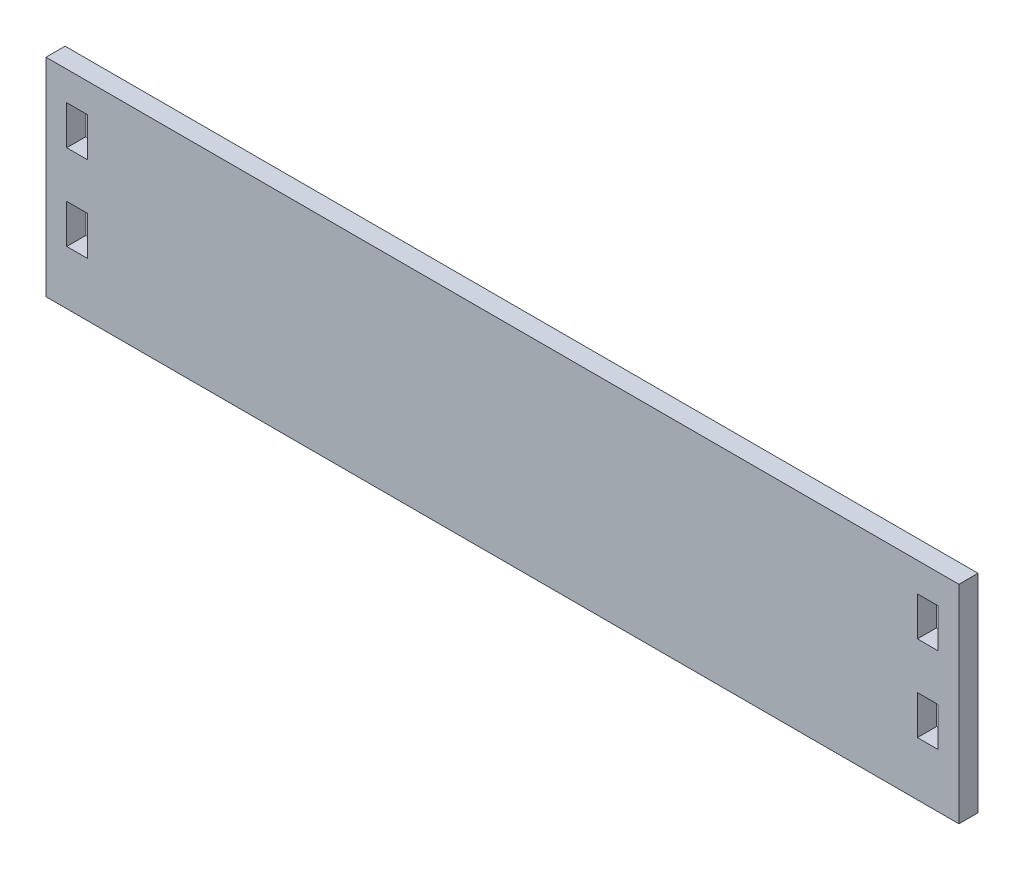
ISO-10303-21;
HEADER;
FILE_DESCRIPTION(('STEP AP214'),'2;1');
FILE_NAME('part.step','',(''),(''),'','','');
FILE_SCHEMA(('AUTOMOTIVE_DESIGN { 1 0 10303 214 1 1 1 1 }'));
ENDSEC;
DATA;
#1=APPLICATION_CONTEXT('core data for automotive mechanical design processes');
#2=APPLICATION_PROTOCOL_DEFINITION('international standard','automotive_design',2000,#1);
#3=PRODUCT_CONTEXT('',#1,'mechanical');
#4=PRODUCT('Part','Part','',(#3));
#5=PRODUCT_RELATED_PRODUCT_CATEGORY('part','',(#4));
#6=PRODUCT_DEFINITION_FORMATION('','',#4);
#7=PRODUCT_DEFINITION_CONTEXT('part definition',#1,'design');
#8=PRODUCT_DEFINITION('design','',#6,#7);
#9=PRODUCT_DEFINITION_SHAPE('','',#8);
#10=(LENGTH_UNIT() NAMED_UNIT(*) SI_UNIT(.MILLI.,.METRE.));
#11=(NAMED_UNIT(*) PLANE_ANGLE_UNIT() SI_UNIT($,.RADIAN.));
#12=(NAMED_UNIT(*) SI_UNIT($,.STERADIAN.) SOLID_ANGLE_UNIT());
#13=UNCERTAINTY_MEASURE_WITH_UNIT(LENGTH_MEASURE(1.E-05),#10,'distance_accuracy_value','');
#14=(GEOMETRIC_REPRESENTATION_CONTEXT(3) GLOBAL_UNCERTAINTY_ASSIGNED_CONTEXT((#13)) GLOBAL_UNIT_ASSIGNED_CONTEXT((#10,
#11,#12)) REPRESENTATION_CONTEXT('',''));
#15=CARTESIAN_POINT('',(0.,0.,0.));
#16=DIRECTION('',(0.,0.,1.));
#17=DIRECTION('',(1.,0.,0.));
#18=AXIS2_PLACEMENT_3D('',#15,#16,#17);
#19=CARTESIAN_POINT('',(0.,0.,5.842));
#20=DIRECTION('',(0.,0.,-1.));
#21=DIRECTION('',(-1.,0.,0.));
#22=AXIS2_PLACEMENT_3D('',#19,#20,#21);
#23=PLANE('',#22);
#24=DIRECTION('',(-1.,0.,0.));
#25=VECTOR('',#24,1.);
#26=CARTESIAN_POINT('',(273.05,54.61,5.842));
#27=LINE('',#26,#25);
#28=CARTESIAN_POINT('',(273.05,54.61,5.842));
#29=VERTEX_POINT('',#28);
#30=CARTESIAN_POINT('',(266.7,54.61,5.842));
#31=VERTEX_POINT('',#30);
#32=EDGE_CURVE('E206',#29,#31,#27,.T.);
#33=ORIENTED_EDGE('',*,*,#32,.F.);
#34=DIRECTION('',(0.,1.,0.));
#35=VECTOR('',#34,1.);
#36=CARTESIAN_POINT('',(273.05,54.61,5.842));
#37=LINE('',#36,#35);
#38=CARTESIAN_POINT('',(273.05,42.672,5.842));
#39=VERTEX_POINT('',#38);
#40=EDGE_CURVE('E214',#39,#29,#37,.T.);
#41=ORIENTED_EDGE('',*,*,#40,.F.);
#42=DIRECTION('',(1.,0.,0.));
#43=VECTOR('',#42,1.);
#44=CARTESIAN_POINT('',(273.05,42.672,5.842));
#45=LINE('',#44,#43);
#46=CARTESIAN_POINT('',(266.7,42.672,5.842));
#47=VERTEX_POINT('',#46);
#48=EDGE_CURVE('E211',#47,#39,#45,.T.);
#49=ORIENTED_EDGE('',*,*,#48,.F.);
#50=DIRECTION('',(0.,-1.,0.));
#51=VECTOR('',#50,1.);
#52=CARTESIAN_POINT('',(266.7,54.61,5.842));
#53=LINE('',#52,#51);
#54=EDGE_CURVE('E208',#31,#47,#53,.T.);
#55=ORIENTED_EDGE('',*,*,#54,.F.);
#56=EDGE_LOOP('',(#33,#41,#49,#55));
#57=FACE_BOUND('',#56,.T.);
#58=DIRECTION('',(0.,-1.,0.));
#59=VECTOR('',#58,1.);
#60=CARTESIAN_POINT('',(6.35,28.448,5.842));
#61=LINE('',#60,#59);
#62=CARTESIAN_POINT('',(6.35,28.448,5.842));
#63=VERTEX_POINT('',#62);
#64=CARTESIAN_POINT('',(6.35,16.51,5.842));
#65=VERTEX_POINT('',#64);
#66=EDGE_CURVE('E268',#63,#65,#61,.T.);
#67=ORIENTED_EDGE('',*,*,#66,.F.);
#68=DIRECTION('',(-1.,0.,0.));
#69=VECTOR('',#68,1.);
#70=CARTESIAN_POINT('',(6.35,28.448,5.842));
#71=LINE('',#70,#69);
#72=CARTESIAN_POINT('',(12.7,28.448,5.842));
#73=VERTEX_POINT('',#72);
#74=EDGE_CURVE('E276',#73,#63,#71,.T.);
#75=ORIENTED_EDGE('',*,*,#74,.F.);
#76=DIRECTION('',(0.,1.,0.));
#77=VECTOR('',#76,1.);
#78=CARTESIAN_POINT('',(12.7,28.448,5.842));
#79=LINE('',#78,#77);
#80=CARTESIAN_POINT('',(12.7,16.51,5.842));
#81=VERTEX_POINT('',#80);
#82=EDGE_CURVE('E273',#81,#73,#79,.T.);
#83=ORIENTED_EDGE('',*,*,#82,.F.);
#84=DIRECTION('',(1.,0.,0.));
#85=VECTOR('',#84,1.);
#86=CARTESIAN_POINT('',(6.35,16.51,5.842));
#87=LINE('',#86,#85);
#88=EDGE_CURVE('E270',#65,#81,#87,.T.);
#89=ORIENTED_EDGE('',*,*,#88,.F.);
#90=EDGE_LOOP('',(#67,#75,#83,#89));
#91=FACE_BOUND('',#90,.T.);
#92=DIRECTION('',(0.,-1.,0.));
#93=VECTOR('',#92,1.);
#94=CARTESIAN_POINT('',(0.,0.,5.842));
#95=LINE('',#94,#93);
#96=CARTESIAN_POINT('',(0.,63.5,5.842));
#97=VERTEX_POINT('',#96);
#98=CARTESIAN_POINT('',(0.,0.,5.842));
#99=VERTEX_POINT('',#98);
#100=EDGE_CURVE('E299',#97,#99,#95,.T.);
#101=ORIENTED_EDGE('',*,*,#100,.T.);
#102=DIRECTION('',(1.,0.,0.));
#103=VECTOR('',#102,1.);
#104=CARTESIAN_POINT('',(0.,0.,5.842));
#105=LINE('',#104,#103);
#106=CARTESIAN_POINT('',(279.4,0.,5.842));
#107=VERTEX_POINT('',#106);
#108=EDGE_CURVE('E302',#99,#107,#105,.T.);
#109=ORIENTED_EDGE('',*,*,#108,.T.);
#110=DIRECTION('',(0.,1.,0.));
#111=VECTOR('',#110,1.);
#112=CARTESIAN_POINT('',(279.4,0.,5.842));
#113=LINE('',#112,#111);
#114=CARTESIAN_POINT('',(279.4,63.5,5.842));
#115=VERTEX_POINT('',#114);
#116=EDGE_CURVE('E305',#107,#115,#113,.T.);
#117=ORIENTED_EDGE('',*,*,#116,.T.);
#118=DIRECTION('',(-1.,0.,0.));
#119=VECTOR('',#118,1.);
#120=CARTESIAN_POINT('',(0.,63.5,5.842));
#121=LINE('',#120,#119);
#122=EDGE_CURVE('E307',#115,#97,#121,.T.);
#123=ORIENTED_EDGE('',*,*,#122,.T.);
#124=EDGE_LOOP('',(#101,#109,#117,#123));
#125=FACE_BOUND('',#124,.T.);
#126=DIRECTION('',(0.,-1.,0.));
#127=VECTOR('',#126,1.);
#128=CARTESIAN_POINT('',(6.35,54.61,5.842));
#129=LINE('',#128,#127);
#130=CARTESIAN_POINT('',(6.35,54.61,5.842));
#131=VERTEX_POINT('',#130);
#132=CARTESIAN_POINT('',(6.35,42.672,5.842));
#133=VERTEX_POINT('',#132);
#134=EDGE_CURVE('E237',#131,#133,#129,.T.);
#135=ORIENTED_EDGE('',*,*,#134,.F.);
#136=DIRECTION('',(-1.,0.,0.));
#137=VECTOR('',#136,1.);
#138=CARTESIAN_POINT('',(6.35,54.61,5.842));
#139=LINE('',#138,#137);
#140=CARTESIAN_POINT('',(12.7,54.61,5.842));
#141=VERTEX_POINT('',#140);
#142=EDGE_CURVE('E245',#141,#131,#139,.T.);
#143=ORIENTED_EDGE('',*,*,#142,.F.);
#144=DIRECTION('',(0.,1.,0.));
#145=VECTOR('',#144,1.);
#146=CARTESIAN_POINT('',(12.7,54.61,5.842));
#147=LINE('',#146,#145);
#148=CARTESIAN_POINT('',(12.7,42.672,5.842));
#149=VERTEX_POINT('',#148);
#150=EDGE_CURVE('E242',#149,#141,#147,.T.);
#151=ORIENTED_EDGE('',*,*,#150,.F.);
#152=DIRECTION('',(1.,0.,0.));
#153=VECTOR('',#152,1.);
#154=CARTESIAN_POINT('',(6.35,42.672,5.842));
#155=LINE('',#154,#153);
#156=EDGE_CURVE('E239',#133,#149,#155,.T.);
#157=ORIENTED_EDGE('',*,*,#156,.F.);
#158=EDGE_LOOP('',(#135,#143,#151,#157));
#159=FACE_BOUND('',#158,.T.);
#160=DIRECTION('',(-1.,0.,0.));
#161=VECTOR('',#160,1.);
#162=CARTESIAN_POINT('',(273.05,28.4480000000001,5.842));
#163=LINE('',#162,#161);
#164=CARTESIAN_POINT('',(273.05,28.4480000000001,5.842));
#165=VERTEX_POINT('',#164);
#166=CARTESIAN_POINT('',(266.7,28.448,5.842));
#167=VERTEX_POINT('',#166);
#168=EDGE_CURVE('E170',#165,#167,#163,.T.);
#169=ORIENTED_EDGE('',*,*,#168,.F.);
#170=DIRECTION('',(0.,1.,0.));
#171=VECTOR('',#170,1.);
#172=CARTESIAN_POINT('',(273.05,28.4480000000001,5.842));
#173=LINE('',#172,#171);
#174=CARTESIAN_POINT('',(273.05,16.51,5.842));
#175=VERTEX_POINT('',#174);
#176=EDGE_CURVE('E192',#175,#165,#173,.T.);
#177=ORIENTED_EDGE('',*,*,#176,.F.);
#178=DIRECTION('',(1.,0.,0.));
#179=VECTOR('',#178,1.);
#180=CARTESIAN_POINT('',(273.05,16.51,5.842));
#181=LINE('',#180,#179);
#182=CARTESIAN_POINT('',(266.7,16.5100000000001,5.842));
#183=VERTEX_POINT('',#182);
#184=EDGE_CURVE('E190',#183,#175,#181,.T.);
#185=ORIENTED_EDGE('',*,*,#184,.F.);
#186=DIRECTION('',(0.,-1.,0.));
#187=VECTOR('',#186,1.);
#188=CARTESIAN_POINT('',(266.7,28.448,5.842));
#189=LINE('',#188,#187);
#190=EDGE_CURVE('E178',#167,#183,#189,.T.);
#191=ORIENTED_EDGE('',*,*,#190,.F.);
#192=EDGE_LOOP('',(#169,#177,#185,#191));
#193=FACE_BOUND('',#192,.T.);
#194=ADVANCED_FACE('F33',(#57,#91,#125,#159,#193),#23,.F.);
#195=CARTESIAN_POINT('',(0.,0.,0.));
#196=DIRECTION('',(0.,0.,-1.));
#197=DIRECTION('',(-1.,0.,0.));
#198=AXIS2_PLACEMENT_3D('',#195,#196,#197);
#199=PLANE('',#198);
#200=DIRECTION('',(0.,-1.,0.));
#201=VECTOR('',#200,1.);
#202=CARTESIAN_POINT('',(0.,0.,0.));
#203=LINE('',#202,#201);
#204=CARTESIAN_POINT('',(0.,63.5,0.));
#205=VERTEX_POINT('',#204);
#206=CARTESIAN_POINT('',(0.,0.,0.));
#207=VERTEX_POINT('',#206);
#208=EDGE_CURVE('E298',#205,#207,#203,.T.);
#209=ORIENTED_EDGE('',*,*,#208,.F.);
#210=DIRECTION('',(-1.,0.,0.));
#211=VECTOR('',#210,1.);
#212=CARTESIAN_POINT('',(0.,63.5,0.));
#213=LINE('',#212,#211);
#214=CARTESIAN_POINT('',(279.4,63.5,0.));
#215=VERTEX_POINT('',#214);
#216=EDGE_CURVE('E303',#215,#205,#213,.T.);
#217=ORIENTED_EDGE('',*,*,#216,.F.);
#218=DIRECTION('',(0.,1.,0.));
#219=VECTOR('',#218,1.);
#220=CARTESIAN_POINT('',(279.4,0.,0.));
#221=LINE('',#220,#219);
#222=CARTESIAN_POINT('',(279.4,0.,0.));
#223=VERTEX_POINT('',#222);
#224=EDGE_CURVE('E314',#223,#215,#221,.T.);
#225=ORIENTED_EDGE('',*,*,#224,.F.);
#226=DIRECTION('',(1.,0.,0.));
#227=VECTOR('',#226,1.);
#228=CARTESIAN_POINT('',(0.,0.,0.));
#229=LINE('',#228,#227);
#230=EDGE_CURVE('E312',#207,#223,#229,.T.);
#231=ORIENTED_EDGE('',*,*,#230,.F.);
#232=EDGE_LOOP('',(#209,#217,#225,#231));
#233=FACE_BOUND('',#232,.T.);
#234=DIRECTION('',(-1.,0.,0.));
#235=VECTOR('',#234,1.);
#236=CARTESIAN_POINT('',(6.35,28.448,0.));
#237=LINE('',#236,#235);
#238=CARTESIAN_POINT('',(12.7,28.448,0.));
#239=VERTEX_POINT('',#238);
#240=CARTESIAN_POINT('',(6.35,28.448,0.));
#241=VERTEX_POINT('',#240);
#242=EDGE_CURVE('E271',#239,#241,#237,.T.);
#243=ORIENTED_EDGE('',*,*,#242,.T.);
#244=DIRECTION('',(0.,-1.,0.));
#245=VECTOR('',#244,1.);
#246=CARTESIAN_POINT('',(6.35,28.448,0.));
#247=LINE('',#246,#245);
#248=CARTESIAN_POINT('',(6.35,16.51,0.));
#249=VERTEX_POINT('',#248);
#250=EDGE_CURVE('E267',#241,#249,#247,.T.);
#251=ORIENTED_EDGE('',*,*,#250,.T.);
#252=DIRECTION('',(1.,0.,0.));
#253=VECTOR('',#252,1.);
#254=CARTESIAN_POINT('',(6.35,16.51,0.));
#255=LINE('',#254,#253);
#256=CARTESIAN_POINT('',(12.7,16.51,0.));
#257=VERTEX_POINT('',#256);
#258=EDGE_CURVE('E281',#249,#257,#255,.T.);
#259=ORIENTED_EDGE('',*,*,#258,.T.);
#260=DIRECTION('',(0.,1.,0.));
#261=VECTOR('',#260,1.);
#262=CARTESIAN_POINT('',(12.7,28.448,0.));
#263=LINE('',#262,#261);
#264=EDGE_CURVE('E284',#257,#239,#263,.T.);
#265=ORIENTED_EDGE('',*,*,#264,.T.);
#266=EDGE_LOOP('',(#243,#251,#259,#265));
#267=FACE_BOUND('',#266,.T.);
#268=DIRECTION('',(-1.,0.,0.));
#269=VECTOR('',#268,1.);
#270=CARTESIAN_POINT('',(6.35,54.61,0.));
#271=LINE('',#270,#269);
#272=CARTESIAN_POINT('',(12.7,54.61,0.));
#273=VERTEX_POINT('',#272);
#274=CARTESIAN_POINT('',(6.35,54.61,0.));
#275=VERTEX_POINT('',#274);
#276=EDGE_CURVE('E240',#273,#275,#271,.T.);
#277=ORIENTED_EDGE('',*,*,#276,.T.);
#278=DIRECTION('',(0.,-1.,0.));
#279=VECTOR('',#278,1.);
#280=CARTESIAN_POINT('',(6.35,54.61,0.));
#281=LINE('',#280,#279);
#282=CARTESIAN_POINT('',(6.35,42.672,0.));
#283=VERTEX_POINT('',#282);
#284=EDGE_CURVE('E236',#275,#283,#281,.T.);
#285=ORIENTED_EDGE('',*,*,#284,.T.);
#286=DIRECTION('',(1.,0.,0.));
#287=VECTOR('',#286,1.);
#288=CARTESIAN_POINT('',(6.35,42.672,0.));
#289=LINE('',#288,#287);
#290=CARTESIAN_POINT('',(12.7,42.672,0.));
#291=VERTEX_POINT('',#290);
#292=EDGE_CURVE('E250',#283,#291,#289,.T.);
#293=ORIENTED_EDGE('',*,*,#292,.T.);
#294=DIRECTION('',(0.,1.,0.));
#295=VECTOR('',#294,1.);
#296=CARTESIAN_POINT('',(12.7,54.61,0.));
#297=LINE('',#296,#295);
#298=EDGE_CURVE('E253',#291,#273,#297,.T.);
#299=ORIENTED_EDGE('',*,*,#298,.T.);
#300=EDGE_LOOP('',(#277,#285,#293,#299));
#301=FACE_BOUND('',#300,.T.);
#302=DIRECTION('',(0.,1.,0.));
#303=VECTOR('',#302,1.);
#304=CARTESIAN_POINT('',(273.05,54.61,0.));
#305=LINE('',#304,#303);
#306=CARTESIAN_POINT('',(273.05,42.672,0.));
#307=VERTEX_POINT('',#306);
#308=CARTESIAN_POINT('',(273.05,54.61,0.));
#309=VERTEX_POINT('',#308);
#310=EDGE_CURVE('E209',#307,#309,#305,.T.);
#311=ORIENTED_EDGE('',*,*,#310,.T.);
#312=DIRECTION('',(-1.,0.,0.));
#313=VECTOR('',#312,1.);
#314=CARTESIAN_POINT('',(273.05,54.61,0.));
#315=LINE('',#314,#313);
#316=CARTESIAN_POINT('',(266.7,54.61,0.));
#317=VERTEX_POINT('',#316);
#318=EDGE_CURVE('E186',#309,#317,#315,.T.);
#319=ORIENTED_EDGE('',*,*,#318,.T.);
#320=DIRECTION('',(0.,-1.,0.));
#321=VECTOR('',#320,1.);
#322=CARTESIAN_POINT('',(266.7,54.61,0.));
#323=LINE('',#322,#321);
#324=CARTESIAN_POINT('',(266.7,42.672,0.));
#325=VERTEX_POINT('',#324);
#326=EDGE_CURVE('E219',#317,#325,#323,.T.);
#327=ORIENTED_EDGE('',*,*,#326,.T.);
#328=DIRECTION('',(1.,0.,0.));
#329=VECTOR('',#328,1.);
#330=CARTESIAN_POINT('',(273.05,42.672,0.));
#331=LINE('',#330,#329);
#332=EDGE_CURVE('E222',#325,#307,#331,.T.);
#333=ORIENTED_EDGE('',*,*,#332,.T.);
#334=EDGE_LOOP('',(#311,#319,#327,#333));
#335=FACE_BOUND('',#334,.T.);
#336=DIRECTION('',(0.,1.,0.));
#337=VECTOR('',#336,1.);
#338=CARTESIAN_POINT('',(273.05,28.4480000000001,0.));
#339=LINE('',#338,#337);
#340=CARTESIAN_POINT('',(273.05,16.51,0.));
#341=VERTEX_POINT('',#340);
#342=CARTESIAN_POINT('',(273.05,28.4480000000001,0.));
#343=VERTEX_POINT('',#342);
#344=EDGE_CURVE('E179',#341,#343,#339,.T.);
#345=ORIENTED_EDGE('',*,*,#344,.T.);
#346=DIRECTION('',(-1.,0.,0.));
#347=VECTOR('',#346,1.);
#348=CARTESIAN_POINT('',(273.05,28.4480000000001,0.));
#349=LINE('',#348,#347);
#350=CARTESIAN_POINT('',(266.7,28.448,0.));
#351=VERTEX_POINT('',#350);
#352=EDGE_CURVE('E56',#343,#351,#349,.T.);
#353=ORIENTED_EDGE('',*,*,#352,.T.);
#354=DIRECTION('',(0.,-1.,0.));
#355=VECTOR('',#354,1.);
#356=CARTESIAN_POINT('',(266.7,28.448,0.));
#357=LINE('',#356,#355);
#358=CARTESIAN_POINT('',(266.7,16.5100000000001,0.));
#359=VERTEX_POINT('',#358);
#360=EDGE_CURVE('E185',#351,#359,#357,.T.);
#361=ORIENTED_EDGE('',*,*,#360,.T.);
#362=DIRECTION('',(1.,0.,0.));
#363=VECTOR('',#362,1.);
#364=CARTESIAN_POINT('',(273.05,16.51,0.));
#365=LINE('',#364,#363);
#366=EDGE_CURVE('E198',#359,#341,#365,.T.);
#367=ORIENTED_EDGE('',*,*,#366,.T.);
#368=EDGE_LOOP('',(#345,#353,#361,#367));
#369=FACE_BOUND('',#368,.T.);
#370=ADVANCED_FACE('F332',(#233,#267,#301,#335,#369),#199,.T.);
#371=CARTESIAN_POINT('',(0.,0.,5.842));
#372=DIRECTION('',(1.,0.,0.));
#373=DIRECTION('',(0.,0.,-1.));
#374=AXIS2_PLACEMENT_3D('',#371,#372,#373);
#375=PLANE('',#374);
#376=ORIENTED_EDGE('',*,*,#208,.T.);
#377=DIRECTION('',(0.,0.,-1.));
#378=VECTOR('',#377,1.);
#379=CARTESIAN_POINT('',(0.,0.,5.842));
#380=LINE('',#379,#378);
#381=EDGE_CURVE('E11',#99,#207,#380,.T.);
#382=ORIENTED_EDGE('',*,*,#381,.F.);
#383=ORIENTED_EDGE('',*,*,#100,.F.);
#384=DIRECTION('',(0.,0.,-1.));
#385=VECTOR('',#384,1.);
#386=CARTESIAN_POINT('',(0.,63.5,5.842));
#387=LINE('',#386,#385);
#388=EDGE_CURVE('E309',#97,#205,#387,.T.);
#389=ORIENTED_EDGE('',*,*,#388,.T.);
#390=EDGE_LOOP('',(#376,#382,#383,#389));
#391=FACE_BOUND('',#390,.T.);
#392=ADVANCED_FACE('F35',(#391),#375,.F.);
#393=CARTESIAN_POINT('',(0.,0.,5.842));
#394=DIRECTION('',(0.,1.,0.));
#395=DIRECTION('',(0.,0.,1.));
#396=AXIS2_PLACEMENT_3D('',#393,#394,#395);
#397=PLANE('',#396);
#398=ORIENTED_EDGE('',*,*,#230,.T.);
#399=DIRECTION('',(0.,0.,-1.));
#400=VECTOR('',#399,1.);
#401=CARTESIAN_POINT('',(279.4,0.,5.842));
#402=LINE('',#401,#400);
#403=EDGE_CURVE('E41',#107,#223,#402,.T.);
#404=ORIENTED_EDGE('',*,*,#403,.F.);
#405=ORIENTED_EDGE('',*,*,#108,.F.);
#406=ORIENTED_EDGE('',*,*,#381,.T.);
#407=EDGE_LOOP('',(#398,#404,#405,#406));
#408=FACE_BOUND('',#407,.T.);
#409=ADVANCED_FACE('F343',(#408),#397,.F.);
#410=CARTESIAN_POINT('',(279.4,0.,5.842));
#411=DIRECTION('',(-1.,0.,0.));
#412=DIRECTION('',(0.,0.,1.));
#413=AXIS2_PLACEMENT_3D('',#410,#411,#412);
#414=PLANE('',#413);
#415=ORIENTED_EDGE('',*,*,#224,.T.);
#416=DIRECTION('',(0.,0.,-1.));
#417=VECTOR('',#416,1.);
#418=CARTESIAN_POINT('',(279.4,63.5,5.842));
#419=LINE('',#418,#417);
#420=EDGE_CURVE('E319',#115,#215,#419,.T.);
#421=ORIENTED_EDGE('',*,*,#420,.F.);
#422=ORIENTED_EDGE('',*,*,#116,.F.);
#423=ORIENTED_EDGE('',*,*,#403,.T.);
#424=EDGE_LOOP('',(#415,#421,#422,#423));
#425=FACE_BOUND('',#424,.T.);
#426=ADVANCED_FACE('F326',(#425),#414,.F.);
#427=CARTESIAN_POINT('',(0.,63.5,5.842));
#428=DIRECTION('',(0.,-1.,0.));
#429=DIRECTION('',(0.,0.,-1.));
#430=AXIS2_PLACEMENT_3D('',#427,#428,#429);
#431=PLANE('',#430);
#432=ORIENTED_EDGE('',*,*,#216,.T.);
#433=ORIENTED_EDGE('',*,*,#388,.F.);
#434=ORIENTED_EDGE('',*,*,#122,.F.);
#435=ORIENTED_EDGE('',*,*,#420,.T.);
#436=EDGE_LOOP('',(#432,#433,#434,#435));
#437=FACE_BOUND('',#436,.T.);
#438=ADVANCED_FACE('F336',(#437),#431,.F.);
#439=CARTESIAN_POINT('',(6.35,28.448,5.842));
#440=DIRECTION('',(1.,0.,0.));
#441=DIRECTION('',(0.,1.,0.));
#442=AXIS2_PLACEMENT_3D('',#439,#440,#441);
#443=PLANE('',#442);
#444=ORIENTED_EDGE('',*,*,#250,.F.);
#445=DIRECTION('',(0.,0.,-1.));
#446=VECTOR('',#445,1.);
#447=CARTESIAN_POINT('',(6.35,28.448,5.842));
#448=LINE('',#447,#446);
#449=EDGE_CURVE('E278',#63,#241,#448,.T.);
#450=ORIENTED_EDGE('',*,*,#449,.F.);
#451=ORIENTED_EDGE('',*,*,#66,.T.);
#452=DIRECTION('',(0.,0.,-1.));
#453=VECTOR('',#452,1.);
#454=CARTESIAN_POINT('',(6.35,16.51,5.842));
#455=LINE('',#454,#453);
#456=EDGE_CURVE('E295',#65,#249,#455,.T.);
#457=ORIENTED_EDGE('',*,*,#456,.T.);
#458=EDGE_LOOP('',(#444,#450,#451,#457));
#459=FACE_BOUND('',#458,.T.);
#460=ADVANCED_FACE('F360',(#459),#443,.T.);
#461=CARTESIAN_POINT('',(6.35,16.51,5.842));
#462=DIRECTION('',(0.,1.,0.));
#463=DIRECTION('',(0.,0.,1.));
#464=AXIS2_PLACEMENT_3D('',#461,#462,#463);
#465=PLANE('',#464);
#466=ORIENTED_EDGE('',*,*,#258,.F.);
#467=ORIENTED_EDGE('',*,*,#456,.F.);
#468=ORIENTED_EDGE('',*,*,#88,.T.);
#469=DIRECTION('',(0.,0.,-1.));
#470=VECTOR('',#469,1.);
#471=CARTESIAN_POINT('',(12.7,16.51,5.842));
#472=LINE('',#471,#470);
#473=EDGE_CURVE('E293',#81,#257,#472,.T.);
#474=ORIENTED_EDGE('',*,*,#473,.T.);
#475=EDGE_LOOP('',(#466,#467,#468,#474));
#476=FACE_BOUND('',#475,.T.);
#477=ADVANCED_FACE('F367',(#476),#465,.T.);
#478=CARTESIAN_POINT('',(12.7,28.448,5.842));
#479=DIRECTION('',(-1.,0.,0.));
#480=DIRECTION('',(0.,-1.,0.));
#481=AXIS2_PLACEMENT_3D('',#478,#479,#480);
#482=PLANE('',#481);
#483=ORIENTED_EDGE('',*,*,#264,.F.);
#484=ORIENTED_EDGE('',*,*,#473,.F.);
#485=ORIENTED_EDGE('',*,*,#82,.T.);
#486=DIRECTION('',(0.,0.,-1.));
#487=VECTOR('',#486,1.);
#488=CARTESIAN_POINT('',(12.7,28.448,5.842));
#489=LINE('',#488,#487);
#490=EDGE_CURVE('E291',#73,#239,#489,.T.);
#491=ORIENTED_EDGE('',*,*,#490,.T.);
#492=EDGE_LOOP('',(#483,#484,#485,#491));
#493=FACE_BOUND('',#492,.T.);
#494=ADVANCED_FACE('F372',(#493),#482,.T.);
#495=CARTESIAN_POINT('',(6.35,28.448,5.842));
#496=DIRECTION('',(0.,-1.,0.));
#497=DIRECTION('',(1.,0.,0.));
#498=AXIS2_PLACEMENT_3D('',#495,#496,#497);
#499=PLANE('',#498);
#500=ORIENTED_EDGE('',*,*,#242,.F.);
#501=ORIENTED_EDGE('',*,*,#490,.F.);
#502=ORIENTED_EDGE('',*,*,#74,.T.);
#503=ORIENTED_EDGE('',*,*,#449,.T.);
#504=EDGE_LOOP('',(#500,#501,#502,#503));
#505=FACE_BOUND('',#504,.T.);
#506=ADVANCED_FACE('F379',(#505),#499,.T.);
#507=CARTESIAN_POINT('',(6.35,54.61,5.842));
#508=DIRECTION('',(1.,0.,0.));
#509=DIRECTION('',(0.,1.,0.));
#510=AXIS2_PLACEMENT_3D('',#507,#508,#509);
#511=PLANE('',#510);
#512=ORIENTED_EDGE('',*,*,#284,.F.);
#513=DIRECTION('',(0.,0.,-1.));
#514=VECTOR('',#513,1.);
#515=CARTESIAN_POINT('',(6.35,54.61,5.842));
#516=LINE('',#515,#514);
#517=EDGE_CURVE('E247',#131,#275,#516,.T.);
#518=ORIENTED_EDGE('',*,*,#517,.F.);
#519=ORIENTED_EDGE('',*,*,#134,.T.);
#520=DIRECTION('',(0.,0.,-1.));
#521=VECTOR('',#520,1.);
#522=CARTESIAN_POINT('',(6.35,42.672,5.842));
#523=LINE('',#522,#521);
#524=EDGE_CURVE('E264',#133,#283,#523,.T.);
#525=ORIENTED_EDGE('',*,*,#524,.T.);
#526=EDGE_LOOP('',(#512,#518,#519,#525));
#527=FACE_BOUND('',#526,.T.);
#528=ADVANCED_FACE('F392',(#527),#511,.T.);
#529=CARTESIAN_POINT('',(6.35,42.672,5.842));
#530=DIRECTION('',(0.,1.,0.));
#531=DIRECTION('',(-1.,0.,0.));
#532=AXIS2_PLACEMENT_3D('',#529,#530,#531);
#533=PLANE('',#532);
#534=ORIENTED_EDGE('',*,*,#292,.F.);
#535=ORIENTED_EDGE('',*,*,#524,.F.);
#536=ORIENTED_EDGE('',*,*,#156,.T.);
#537=DIRECTION('',(0.,0.,-1.));
#538=VECTOR('',#537,1.);
#539=CARTESIAN_POINT('',(12.7,42.672,5.842));
#540=LINE('',#539,#538);
#541=EDGE_CURVE('E262',#149,#291,#540,.T.);
#542=ORIENTED_EDGE('',*,*,#541,.T.);
#543=EDGE_LOOP('',(#534,#535,#536,#542));
#544=FACE_BOUND('',#543,.T.);
#545=ADVANCED_FACE('F397',(#544),#533,.T.);
#546=CARTESIAN_POINT('',(12.7,54.61,5.842));
#547=DIRECTION('',(-1.,0.,0.));
#548=DIRECTION('',(0.,-1.,0.));
#549=AXIS2_PLACEMENT_3D('',#546,#547,#548);
#550=PLANE('',#549);
#551=ORIENTED_EDGE('',*,*,#298,.F.);
#552=ORIENTED_EDGE('',*,*,#541,.F.);
#553=ORIENTED_EDGE('',*,*,#150,.T.);
#554=DIRECTION('',(0.,0.,-1.));
#555=VECTOR('',#554,1.);
#556=CARTESIAN_POINT('',(12.7,54.61,5.842));
#557=LINE('',#556,#555);
#558=EDGE_CURVE('E260',#141,#273,#557,.T.);
#559=ORIENTED_EDGE('',*,*,#558,.T.);
#560=EDGE_LOOP('',(#551,#552,#553,#559));
#561=FACE_BOUND('',#560,.T.);
#562=ADVANCED_FACE('F401',(#561),#550,.T.);
#563=CARTESIAN_POINT('',(6.35,54.61,5.842));
#564=DIRECTION('',(0.,-1.,0.));
#565=DIRECTION('',(0.,0.,-1.));
#566=AXIS2_PLACEMENT_3D('',#563,#564,#565);
#567=PLANE('',#566);
#568=ORIENTED_EDGE('',*,*,#276,.F.);
#569=ORIENTED_EDGE('',*,*,#558,.F.);
#570=ORIENTED_EDGE('',*,*,#142,.T.);
#571=ORIENTED_EDGE('',*,*,#517,.T.);
#572=EDGE_LOOP('',(#568,#569,#570,#571));
#573=FACE_BOUND('',#572,.T.);
#574=ADVANCED_FACE('F405',(#573),#567,.T.);
#575=CARTESIAN_POINT('',(273.05,54.61,5.842));
#576=DIRECTION('',(0.,-1.,0.));
#577=DIRECTION('',(1.,0.,0.));
#578=AXIS2_PLACEMENT_3D('',#575,#576,#577);
#579=PLANE('',#578);
#580=ORIENTED_EDGE('',*,*,#318,.F.);
#581=DIRECTION('',(0.,0.,-1.));
#582=VECTOR('',#581,1.);
#583=CARTESIAN_POINT('',(273.05,54.61,5.842));
#584=LINE('',#583,#582);
#585=EDGE_CURVE('E216',#29,#309,#584,.T.);
#586=ORIENTED_EDGE('',*,*,#585,.F.);
#587=ORIENTED_EDGE('',*,*,#32,.T.);
#588=DIRECTION('',(0.,0.,-1.));
#589=VECTOR('',#588,1.);
#590=CARTESIAN_POINT('',(266.7,54.61,5.842));
#591=LINE('',#590,#589);
#592=EDGE_CURVE('E233',#31,#317,#591,.T.);
#593=ORIENTED_EDGE('',*,*,#592,.T.);
#594=EDGE_LOOP('',(#580,#586,#587,#593));
#595=FACE_BOUND('',#594,.T.);
#596=ADVANCED_FACE('F409',(#595),#579,.T.);
#597=CARTESIAN_POINT('',(266.7,54.61,5.842));
#598=DIRECTION('',(1.,0.,0.));
#599=DIRECTION('',(0.,0.,-1.));
#600=AXIS2_PLACEMENT_3D('',#597,#598,#599);
#601=PLANE('',#600);
#602=ORIENTED_EDGE('',*,*,#326,.F.);
#603=ORIENTED_EDGE('',*,*,#592,.F.);
#604=ORIENTED_EDGE('',*,*,#54,.T.);
#605=DIRECTION('',(0.,0.,-1.));
#606=VECTOR('',#605,1.);
#607=CARTESIAN_POINT('',(266.7,42.672,5.842));
#608=LINE('',#607,#606);
#609=EDGE_CURVE('E231',#47,#325,#608,.T.);
#610=ORIENTED_EDGE('',*,*,#609,.T.);
#611=EDGE_LOOP('',(#602,#603,#604,#610));
#612=FACE_BOUND('',#611,.T.);
#613=ADVANCED_FACE('F413',(#612),#601,.T.);
#614=CARTESIAN_POINT('',(273.05,42.672,5.842));
#615=DIRECTION('',(0.,1.,0.));
#616=DIRECTION('',(0.,0.,1.));
#617=AXIS2_PLACEMENT_3D('',#614,#615,#616);
#618=PLANE('',#617);
#619=ORIENTED_EDGE('',*,*,#332,.F.);
#620=ORIENTED_EDGE('',*,*,#609,.F.);
#621=ORIENTED_EDGE('',*,*,#48,.T.);
#622=DIRECTION('',(0.,0.,-1.));
#623=VECTOR('',#622,1.);
#624=CARTESIAN_POINT('',(273.05,42.672,5.842));
#625=LINE('',#624,#623);
#626=EDGE_CURVE('E229',#39,#307,#625,.T.);
#627=ORIENTED_EDGE('',*,*,#626,.T.);
#628=EDGE_LOOP('',(#619,#620,#621,#627));
#629=FACE_BOUND('',#628,.T.);
#630=ADVANCED_FACE('F417',(#629),#618,.T.);
#631=CARTESIAN_POINT('',(273.05,54.61,5.842));
#632=DIRECTION('',(-1.,0.,0.));
#633=DIRECTION('',(0.,0.,1.));
#634=AXIS2_PLACEMENT_3D('',#631,#632,#633);
#635=PLANE('',#634);
#636=ORIENTED_EDGE('',*,*,#310,.F.);
#637=ORIENTED_EDGE('',*,*,#626,.F.);
#638=ORIENTED_EDGE('',*,*,#40,.T.);
#639=ORIENTED_EDGE('',*,*,#585,.T.);
#640=EDGE_LOOP('',(#636,#637,#638,#639));
#641=FACE_BOUND('',#640,.T.);
#642=ADVANCED_FACE('F421',(#641),#635,.T.);
#643=CARTESIAN_POINT('',(273.05,28.4480000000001,5.842));
#644=DIRECTION('',(0.,-1.,0.));
#645=DIRECTION('',(1.,0.,0.));
#646=AXIS2_PLACEMENT_3D('',#643,#644,#645);
#647=PLANE('',#646);
#648=ORIENTED_EDGE('',*,*,#352,.F.);
#649=DIRECTION('',(0.,0.,-1.));
#650=VECTOR('',#649,1.);
#651=CARTESIAN_POINT('',(273.05,28.4480000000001,5.842));
#652=LINE('',#651,#650);
#653=EDGE_CURVE('E174',#165,#343,#652,.T.);
#654=ORIENTED_EDGE('',*,*,#653,.F.);
#655=ORIENTED_EDGE('',*,*,#168,.T.);
#656=DIRECTION('',(0.,0.,-1.));
#657=VECTOR('',#656,1.);
#658=CARTESIAN_POINT('',(266.7,28.448,5.842));
#659=LINE('',#658,#657);
#660=EDGE_CURVE('E173',#167,#351,#659,.T.);
#661=ORIENTED_EDGE('',*,*,#660,.T.);
#662=EDGE_LOOP('',(#648,#654,#655,#661));
#663=FACE_BOUND('',#662,.T.);
#664=ADVANCED_FACE('F172',(#663),#647,.T.);
#665=CARTESIAN_POINT('',(266.7,28.448,5.842));
#666=DIRECTION('',(1.,0.,0.));
#667=DIRECTION('',(0.,0.,-1.));
#668=AXIS2_PLACEMENT_3D('',#665,#666,#667);
#669=PLANE('',#668);
#670=ORIENTED_EDGE('',*,*,#360,.F.);
#671=ORIENTED_EDGE('',*,*,#660,.F.);
#672=ORIENTED_EDGE('',*,*,#190,.T.);
#673=DIRECTION('',(0.,0.,-1.));
#674=VECTOR('',#673,1.);
#675=CARTESIAN_POINT('',(266.7,16.5100000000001,5.842));
#676=LINE('',#675,#674);
#677=EDGE_CURVE('E187',#183,#359,#676,.T.);
#678=ORIENTED_EDGE('',*,*,#677,.T.);
#679=EDGE_LOOP('',(#670,#671,#672,#678));
#680=FACE_BOUND('',#679,.T.);
#681=ADVANCED_FACE('F182',(#680),#669,.T.);
#682=CARTESIAN_POINT('',(273.05,16.51,5.842));
#683=DIRECTION('',(0.,1.,0.));
#684=DIRECTION('',(-1.,0.,0.));
#685=AXIS2_PLACEMENT_3D('',#682,#683,#684);
#686=PLANE('',#685);
#687=ORIENTED_EDGE('',*,*,#366,.F.);
#688=ORIENTED_EDGE('',*,*,#677,.F.);
#689=ORIENTED_EDGE('',*,*,#184,.T.);
#690=DIRECTION('',(0.,0.,-1.));
#691=VECTOR('',#690,1.);
#692=CARTESIAN_POINT('',(273.05,16.51,5.842));
#693=LINE('',#692,#691);
#694=EDGE_CURVE('E48',#175,#341,#693,.T.);
#695=ORIENTED_EDGE('',*,*,#694,.T.);
#696=EDGE_LOOP('',(#687,#688,#689,#695));
#697=FACE_BOUND('',#696,.T.);
#698=ADVANCED_FACE('F430',(#697),#686,.T.);
#699=CARTESIAN_POINT('',(273.05,28.4480000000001,5.842));
#700=DIRECTION('',(-1.,0.,0.));
#701=DIRECTION('',(0.,0.,1.));
#702=AXIS2_PLACEMENT_3D('',#699,#700,#701);
#703=PLANE('',#702);
#704=ORIENTED_EDGE('',*,*,#344,.F.);
#705=ORIENTED_EDGE('',*,*,#694,.F.);
#706=ORIENTED_EDGE('',*,*,#176,.T.);
#707=ORIENTED_EDGE('',*,*,#653,.T.);
#708=EDGE_LOOP('',(#704,#705,#706,#707));
#709=FACE_BOUND('',#708,.T.);
#710=ADVANCED_FACE('F433',(#709),#703,.T.);
#711=CLOSED_SHELL('',(#194,#370,#392,#409,#426,#438,#460,#477,#494,#506,#528,#545,#562,#574,
#596,#613,#630,#642,#664,#681,#698,#710));
#712=MANIFOLD_SOLID_BREP('B2',#711);
#713=ADVANCED_BREP_SHAPE_REPRESENTATION('',(#18,#712),#14);
#714=SHAPE_DEFINITION_REPRESENTATION(#9,#713);
ENDSEC;
END-ISO-10303-21;
